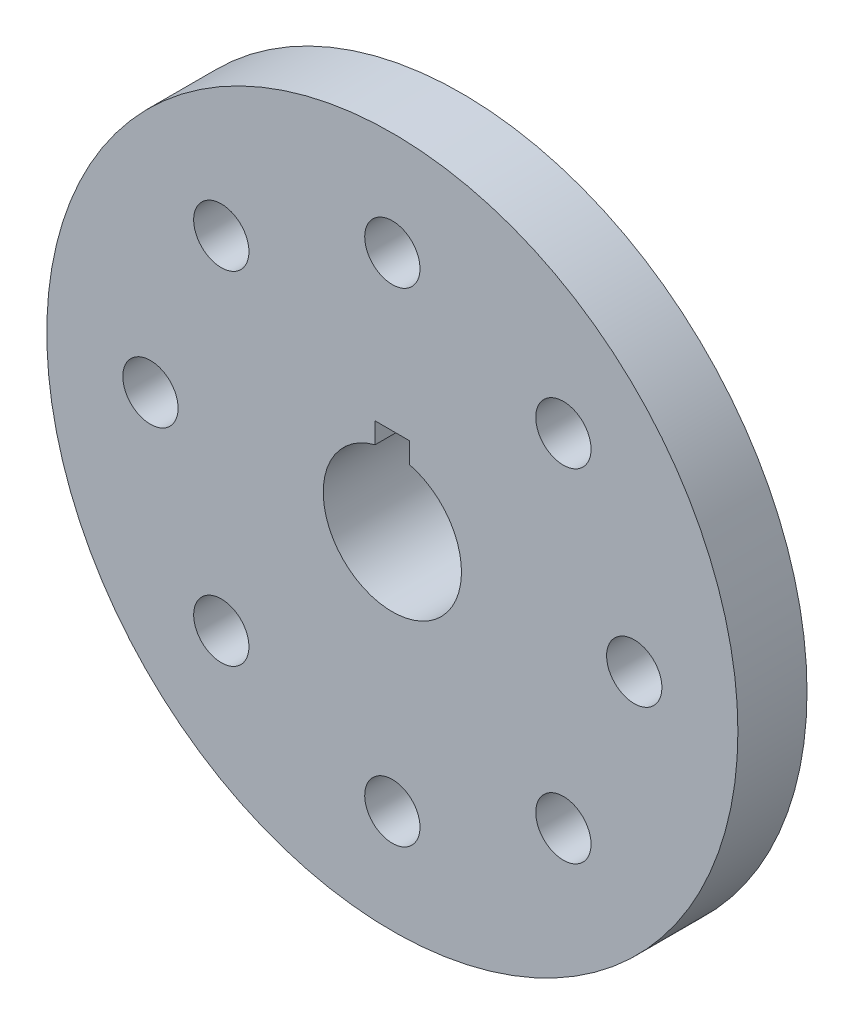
ISO-10303-21;
HEADER;
FILE_DESCRIPTION(('STEP AP214'),'2;1');
FILE_NAME('part.step','',(''),(''),'','','');
FILE_SCHEMA(('AUTOMOTIVE_DESIGN { 1 0 10303 214 1 1 1 1 }'));
ENDSEC;
DATA;
#1=APPLICATION_CONTEXT('core data for automotive mechanical design processes');
#2=APPLICATION_PROTOCOL_DEFINITION('international standard','automotive_design',2000,#1);
#3=PRODUCT_CONTEXT('',#1,'mechanical');
#4=PRODUCT('Part','Part','',(#3));
#5=PRODUCT_RELATED_PRODUCT_CATEGORY('part','',(#4));
#6=PRODUCT_DEFINITION_FORMATION('','',#4);
#7=PRODUCT_DEFINITION_CONTEXT('part definition',#1,'design');
#8=PRODUCT_DEFINITION('design','',#6,#7);
#9=PRODUCT_DEFINITION_SHAPE('','',#8);
#10=(LENGTH_UNIT() NAMED_UNIT(*) SI_UNIT(.MILLI.,.METRE.));
#11=(NAMED_UNIT(*) PLANE_ANGLE_UNIT() SI_UNIT($,.RADIAN.));
#12=(NAMED_UNIT(*) SI_UNIT($,.STERADIAN.) SOLID_ANGLE_UNIT());
#13=UNCERTAINTY_MEASURE_WITH_UNIT(LENGTH_MEASURE(1.E-05),#10,'distance_accuracy_value','');
#14=(GEOMETRIC_REPRESENTATION_CONTEXT(3) GLOBAL_UNCERTAINTY_ASSIGNED_CONTEXT((#13)) GLOBAL_UNIT_ASSIGNED_CONTEXT((#10,
#11,#12)) REPRESENTATION_CONTEXT('',''));
#15=CARTESIAN_POINT('',(0.,0.,0.));
#16=DIRECTION('',(0.,0.,1.));
#17=DIRECTION('',(1.,0.,0.));
#18=AXIS2_PLACEMENT_3D('',#15,#16,#17);
#19=CARTESIAN_POINT('',(0.,0.,-100.));
#20=DIRECTION('',(0.,0.,1.));
#21=DIRECTION('',(-1.,0.,0.));
#22=AXIS2_PLACEMENT_3D('',#19,#20,#21);
#23=PLANE('',#22);
#24=CARTESIAN_POINT('',(0.,0.,-100.));
#25=DIRECTION('',(0.,0.,1.));
#26=DIRECTION('',(1.,0.,0.));
#27=AXIS2_PLACEMENT_3D('',#24,#25,#26);
#28=CIRCLE('',#27,10.);
#29=CARTESIAN_POINT('',(-2.5,9.68245836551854,-100.));
#30=VERTEX_POINT('',#29);
#31=CARTESIAN_POINT('',(2.5,9.68245836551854,-100.));
#32=VERTEX_POINT('',#31);
#33=EDGE_CURVE('E68',#30,#32,#28,.T.);
#34=ORIENTED_EDGE('',*,*,#33,.T.);
#35=DIRECTION('',(0.,1.,0.));
#36=VECTOR('',#35,1.);
#37=CARTESIAN_POINT('',(2.5,9.68245836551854,-100.));
#38=LINE('',#37,#36);
#39=CARTESIAN_POINT('',(2.5,12.6824583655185,-100.));
#40=VERTEX_POINT('',#39);
#41=EDGE_CURVE('E76',#32,#40,#38,.T.);
#42=ORIENTED_EDGE('',*,*,#41,.T.);
#43=DIRECTION('',(-1.,0.,0.));
#44=VECTOR('',#43,1.);
#45=CARTESIAN_POINT('',(2.5,12.6824583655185,-100.));
#46=LINE('',#45,#44);
#47=CARTESIAN_POINT('',(-2.5,12.6824583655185,-100.));
#48=VERTEX_POINT('',#47);
#49=EDGE_CURVE('E81',#40,#48,#46,.T.);
#50=ORIENTED_EDGE('',*,*,#49,.T.);
#51=DIRECTION('',(0.,-1.,0.));
#52=VECTOR('',#51,1.);
#53=CARTESIAN_POINT('',(-2.5,9.68245836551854,-100.));
#54=LINE('',#53,#52);
#55=EDGE_CURVE('E86',#48,#30,#54,.T.);
#56=ORIENTED_EDGE('',*,*,#55,.T.);
#57=EDGE_LOOP('',(#34,#42,#50,#56));
#58=FACE_BOUND('',#57,.T.);
#59=CARTESIAN_POINT('',(0.,0.,-100.));
#60=DIRECTION('',(0.,0.,1.));
#61=DIRECTION('',(1.,0.,0.));
#62=AXIS2_PLACEMENT_3D('',#59,#60,#61);
#63=CIRCLE('',#62,20.);
#64=CARTESIAN_POINT('',(20.,0.,-100.));
#65=VERTEX_POINT('',#64);
#66=EDGE_CURVE('E11',#65,#65,#63,.T.);
#67=ORIENTED_EDGE('',*,*,#66,.F.);
#68=EDGE_LOOP('',(#67));
#69=FACE_BOUND('',#68,.T.);
#70=ADVANCED_FACE('F28',(#58,#69),#23,.F.);
#71=CARTESIAN_POINT('',(0.,0.,-100.));
#72=DIRECTION('',(0.,0.,-1.));
#73=DIRECTION('',(1.,0.,0.));
#74=AXIS2_PLACEMENT_3D('',#71,#72,#73);
#75=CYLINDRICAL_SURFACE('',#74,20.);
#76=ORIENTED_EDGE('',*,*,#66,.T.);
#77=EDGE_LOOP('',(#76));
#78=FACE_BOUND('',#77,.T.);
#79=CARTESIAN_POINT('',(0.,0.,-85.));
#80=DIRECTION('',(0.,0.,1.));
#81=DIRECTION('',(1.,0.,0.));
#82=AXIS2_PLACEMENT_3D('',#79,#80,#81);
#83=CIRCLE('',#82,20.);
#84=CARTESIAN_POINT('',(20.,0.,-85.));
#85=VERTEX_POINT('',#84);
#86=EDGE_CURVE('E35',#85,#85,#83,.T.);
#87=ORIENTED_EDGE('',*,*,#86,.F.);
#88=EDGE_LOOP('',(#87));
#89=FACE_BOUND('',#88,.T.);
#90=ADVANCED_FACE('F106',(#78,#89),#75,.T.);
#91=CARTESIAN_POINT('',(0.,20.,-85.));
#92=DIRECTION('',(0.,0.,1.));
#93=DIRECTION('',(-1.,0.,0.));
#94=AXIS2_PLACEMENT_3D('',#91,#92,#93);
#95=PLANE('',#94);
#96=CARTESIAN_POINT('',(35.,4.92661467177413E-13,-85.));
#97=DIRECTION('',(0.,0.,1.));
#98=DIRECTION('',(0.707106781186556,-0.707106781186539,0.));
#99=AXIS2_PLACEMENT_3D('',#96,#97,#98);
#100=CIRCLE('',#99,4.);
#101=CARTESIAN_POINT('',(37.8284271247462,-2.82842712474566,-85.));
#102=VERTEX_POINT('',#101);
#103=EDGE_CURVE('E181',#102,#102,#100,.T.);
#104=ORIENTED_EDGE('',*,*,#103,.T.);
#105=EDGE_LOOP('',(#104));
#106=FACE_BOUND('',#105,.T.);
#107=CARTESIAN_POINT('',(24.7487373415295,-24.7487373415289,-85.));
#108=DIRECTION('',(0.,0.,1.));
#109=DIRECTION('',(0.,-1.,0.));
#110=AXIS2_PLACEMENT_3D('',#107,#108,#109);
#111=CIRCLE('',#110,4.);
#112=CARTESIAN_POINT('',(24.7487373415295,-28.7487373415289,-85.));
#113=VERTEX_POINT('',#112);
#114=EDGE_CURVE('E189',#113,#113,#111,.T.);
#115=ORIENTED_EDGE('',*,*,#114,.T.);
#116=EDGE_LOOP('',(#115));
#117=FACE_BOUND('',#116,.T.);
#118=CARTESIAN_POINT('',(3.71230823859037E-13,-35.,-85.));
#119=DIRECTION('',(0.,0.,1.));
#120=DIRECTION('',(-0.707106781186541,-0.707106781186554,0.));
#121=AXIS2_PLACEMENT_3D('',#118,#119,#120);
#122=CIRCLE('',#121,4.);
#123=CARTESIAN_POINT('',(-2.82842712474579,-37.8284271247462,-85.));
#124=VERTEX_POINT('',#123);
#125=EDGE_CURVE('E195',#124,#124,#122,.T.);
#126=ORIENTED_EDGE('',*,*,#125,.T.);
#127=EDGE_LOOP('',(#126));
#128=FACE_BOUND('',#127,.T.);
#129=CARTESIAN_POINT('',(-24.7487373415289,-24.7487373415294,-85.));
#130=DIRECTION('',(0.,0.,1.));
#131=DIRECTION('',(-1.,0.,0.));
#132=AXIS2_PLACEMENT_3D('',#129,#130,#131);
#133=CIRCLE('',#132,4.);
#134=CARTESIAN_POINT('',(-28.7487373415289,-24.7487373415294,-85.));
#135=VERTEX_POINT('',#134);
#136=EDGE_CURVE('E201',#135,#135,#133,.T.);
#137=ORIENTED_EDGE('',*,*,#136,.T.);
#138=EDGE_LOOP('',(#137));
#139=FACE_BOUND('',#138,.T.);
#140=CARTESIAN_POINT('',(-35.,-2.4980018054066E-13,-85.));
#141=DIRECTION('',(0.,0.,1.));
#142=DIRECTION('',(-0.707106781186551,0.707106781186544,0.));
#143=AXIS2_PLACEMENT_3D('',#140,#141,#142);
#144=CIRCLE('',#143,4.);
#145=CARTESIAN_POINT('',(-37.8284271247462,2.82842712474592,-85.));
#146=VERTEX_POINT('',#145);
#147=EDGE_CURVE('E207',#146,#146,#144,.T.);
#148=ORIENTED_EDGE('',*,*,#147,.T.);
#149=EDGE_LOOP('',(#148));
#150=FACE_BOUND('',#149,.T.);
#151=CARTESIAN_POINT('',(-24.7487373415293,24.748737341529,-85.));
#152=DIRECTION('',(0.,0.,1.));
#153=DIRECTION('',(0.,1.,0.));
#154=AXIS2_PLACEMENT_3D('',#151,#152,#153);
#155=CIRCLE('',#154,4.);
#156=CARTESIAN_POINT('',(-24.7487373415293,28.748737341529,-85.));
#157=VERTEX_POINT('',#156);
#158=EDGE_CURVE('E213',#157,#157,#155,.T.);
#159=ORIENTED_EDGE('',*,*,#158,.T.);
#160=EDGE_LOOP('',(#159));
#161=FACE_BOUND('',#160,.T.);
#162=CARTESIAN_POINT('',(-1.28369537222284E-13,35.,-85.));
#163=DIRECTION('',(0.,0.,1.));
#164=DIRECTION('',(0.707106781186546,0.707106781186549,0.));
#165=AXIS2_PLACEMENT_3D('',#162,#163,#164);
#166=CIRCLE('',#165,4.);
#167=CARTESIAN_POINT('',(2.82842712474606,37.8284271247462,-85.));
#168=VERTEX_POINT('',#167);
#169=EDGE_CURVE('E219',#168,#168,#166,.T.);
#170=ORIENTED_EDGE('',*,*,#169,.T.);
#171=EDGE_LOOP('',(#170));
#172=FACE_BOUND('',#171,.T.);
#173=CARTESIAN_POINT('',(24.7487373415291,24.7487373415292,-85.));
#174=DIRECTION('',(0.,0.,1.));
#175=DIRECTION('',(1.,0.,0.));
#176=AXIS2_PLACEMENT_3D('',#173,#174,#175);
#177=CIRCLE('',#176,4.);
#178=CARTESIAN_POINT('',(28.7487373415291,24.7487373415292,-85.));
#179=VERTEX_POINT('',#178);
#180=EDGE_CURVE('E92',#179,#179,#177,.T.);
#181=ORIENTED_EDGE('',*,*,#180,.T.);
#182=EDGE_LOOP('',(#181));
#183=FACE_BOUND('',#182,.T.);
#184=ORIENTED_EDGE('',*,*,#86,.T.);
#185=EDGE_LOOP('',(#184));
#186=FACE_BOUND('',#185,.T.);
#187=CARTESIAN_POINT('',(0.,0.,-85.));
#188=DIRECTION('',(0.,0.,1.));
#189=DIRECTION('',(1.,0.,0.));
#190=AXIS2_PLACEMENT_3D('',#187,#188,#189);
#191=CIRCLE('',#190,50.);
#192=CARTESIAN_POINT('',(50.,0.,-85.));
#193=VERTEX_POINT('',#192);
#194=EDGE_CURVE('E98',#193,#193,#191,.T.);
#195=ORIENTED_EDGE('',*,*,#194,.F.);
#196=EDGE_LOOP('',(#195));
#197=FACE_BOUND('',#196,.T.);
#198=ADVANCED_FACE('F103',(#106,#117,#128,#139,#150,#161,#172,#183,#186,#197),#95,.F.);
#199=CARTESIAN_POINT('',(0.,0.,-100.));
#200=DIRECTION('',(0.,0.,-1.));
#201=DIRECTION('',(1.,0.,0.));
#202=AXIS2_PLACEMENT_3D('',#199,#200,#201);
#203=CYLINDRICAL_SURFACE('',#202,50.);
#204=ORIENTED_EDGE('',*,*,#194,.T.);
#205=EDGE_LOOP('',(#204));
#206=FACE_BOUND('',#205,.T.);
#207=CARTESIAN_POINT('',(0.,0.,-75.));
#208=DIRECTION('',(0.,0.,1.));
#209=DIRECTION('',(1.,0.,0.));
#210=AXIS2_PLACEMENT_3D('',#207,#208,#209);
#211=CIRCLE('',#210,50.);
#212=CARTESIAN_POINT('',(50.,0.,-75.));
#213=VERTEX_POINT('',#212);
#214=EDGE_CURVE('E89',#213,#213,#211,.T.);
#215=ORIENTED_EDGE('',*,*,#214,.F.);
#216=EDGE_LOOP('',(#215));
#217=FACE_BOUND('',#216,.T.);
#218=ADVANCED_FACE('F113',(#206,#217),#203,.T.);
#219=CARTESIAN_POINT('',(0.,50.,-75.));
#220=DIRECTION('',(0.,0.,-1.));
#221=DIRECTION('',(1.,0.,0.));
#222=AXIS2_PLACEMENT_3D('',#219,#220,#221);
#223=PLANE('',#222);
#224=CARTESIAN_POINT('',(35.,4.92661467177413E-13,-75.));
#225=DIRECTION('',(0.,0.,1.));
#226=DIRECTION('',(0.707106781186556,-0.707106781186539,0.));
#227=AXIS2_PLACEMENT_3D('',#224,#225,#226);
#228=CIRCLE('',#227,4.);
#229=CARTESIAN_POINT('',(37.8284271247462,-2.82842712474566,-75.));
#230=VERTEX_POINT('',#229);
#231=EDGE_CURVE('E186',#230,#230,#228,.T.);
#232=ORIENTED_EDGE('',*,*,#231,.F.);
#233=EDGE_LOOP('',(#232));
#234=FACE_BOUND('',#233,.T.);
#235=CARTESIAN_POINT('',(24.7487373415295,-24.7487373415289,-75.));
#236=DIRECTION('',(0.,0.,1.));
#237=DIRECTION('',(0.,-1.,0.));
#238=AXIS2_PLACEMENT_3D('',#235,#236,#237);
#239=CIRCLE('',#238,4.);
#240=CARTESIAN_POINT('',(24.7487373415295,-28.7487373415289,-75.));
#241=VERTEX_POINT('',#240);
#242=EDGE_CURVE('E192',#241,#241,#239,.T.);
#243=ORIENTED_EDGE('',*,*,#242,.F.);
#244=EDGE_LOOP('',(#243));
#245=FACE_BOUND('',#244,.T.);
#246=CARTESIAN_POINT('',(3.71230823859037E-13,-35.,-75.));
#247=DIRECTION('',(0.,0.,1.));
#248=DIRECTION('',(-0.707106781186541,-0.707106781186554,0.));
#249=AXIS2_PLACEMENT_3D('',#246,#247,#248);
#250=CIRCLE('',#249,4.);
#251=CARTESIAN_POINT('',(-2.82842712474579,-37.8284271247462,-75.));
#252=VERTEX_POINT('',#251);
#253=EDGE_CURVE('E198',#252,#252,#250,.T.);
#254=ORIENTED_EDGE('',*,*,#253,.F.);
#255=EDGE_LOOP('',(#254));
#256=FACE_BOUND('',#255,.T.);
#257=CARTESIAN_POINT('',(-24.7487373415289,-24.7487373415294,-75.));
#258=DIRECTION('',(0.,0.,1.));
#259=DIRECTION('',(-1.,0.,0.));
#260=AXIS2_PLACEMENT_3D('',#257,#258,#259);
#261=CIRCLE('',#260,4.);
#262=CARTESIAN_POINT('',(-28.7487373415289,-24.7487373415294,-75.));
#263=VERTEX_POINT('',#262);
#264=EDGE_CURVE('E204',#263,#263,#261,.T.);
#265=ORIENTED_EDGE('',*,*,#264,.F.);
#266=EDGE_LOOP('',(#265));
#267=FACE_BOUND('',#266,.T.);
#268=CARTESIAN_POINT('',(-35.,-2.4980018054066E-13,-75.));
#269=DIRECTION('',(0.,0.,1.));
#270=DIRECTION('',(-0.707106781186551,0.707106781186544,0.));
#271=AXIS2_PLACEMENT_3D('',#268,#269,#270);
#272=CIRCLE('',#271,4.);
#273=CARTESIAN_POINT('',(-37.8284271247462,2.82842712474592,-75.));
#274=VERTEX_POINT('',#273);
#275=EDGE_CURVE('E210',#274,#274,#272,.T.);
#276=ORIENTED_EDGE('',*,*,#275,.F.);
#277=EDGE_LOOP('',(#276));
#278=FACE_BOUND('',#277,.T.);
#279=CARTESIAN_POINT('',(-24.7487373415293,24.748737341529,-75.));
#280=DIRECTION('',(0.,0.,1.));
#281=DIRECTION('',(0.,1.,0.));
#282=AXIS2_PLACEMENT_3D('',#279,#280,#281);
#283=CIRCLE('',#282,4.);
#284=CARTESIAN_POINT('',(-24.7487373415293,28.748737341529,-75.));
#285=VERTEX_POINT('',#284);
#286=EDGE_CURVE('E216',#285,#285,#283,.T.);
#287=ORIENTED_EDGE('',*,*,#286,.F.);
#288=EDGE_LOOP('',(#287));
#289=FACE_BOUND('',#288,.T.);
#290=CARTESIAN_POINT('',(-1.28369537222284E-13,35.,-75.));
#291=DIRECTION('',(0.,0.,1.));
#292=DIRECTION('',(0.707106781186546,0.707106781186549,0.));
#293=AXIS2_PLACEMENT_3D('',#290,#291,#292);
#294=CIRCLE('',#293,4.);
#295=CARTESIAN_POINT('',(2.82842712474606,37.8284271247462,-75.));
#296=VERTEX_POINT('',#295);
#297=EDGE_CURVE('E222',#296,#296,#294,.T.);
#298=ORIENTED_EDGE('',*,*,#297,.F.);
#299=EDGE_LOOP('',(#298));
#300=FACE_BOUND('',#299,.T.);
#301=CARTESIAN_POINT('',(24.7487373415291,24.7487373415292,-75.));
#302=DIRECTION('',(0.,0.,1.));
#303=DIRECTION('',(1.,0.,0.));
#304=AXIS2_PLACEMENT_3D('',#301,#302,#303);
#305=CIRCLE('',#304,4.);
#306=CARTESIAN_POINT('',(28.7487373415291,24.7487373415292,-75.));
#307=VERTEX_POINT('',#306);
#308=EDGE_CURVE('E87',#307,#307,#305,.T.);
#309=ORIENTED_EDGE('',*,*,#308,.F.);
#310=EDGE_LOOP('',(#309));
#311=FACE_BOUND('',#310,.T.);
#312=DIRECTION('',(-1.,0.,0.));
#313=VECTOR('',#312,1.);
#314=CARTESIAN_POINT('',(2.5,12.6824583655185,-75.));
#315=LINE('',#314,#313);
#316=CARTESIAN_POINT('',(2.5,12.6824583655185,-75.));
#317=VERTEX_POINT('',#316);
#318=CARTESIAN_POINT('',(-2.5,12.6824583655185,-75.));
#319=VERTEX_POINT('',#318);
#320=EDGE_CURVE('E176',#317,#319,#315,.T.);
#321=ORIENTED_EDGE('',*,*,#320,.F.);
#322=DIRECTION('',(0.,1.,0.));
#323=VECTOR('',#322,1.);
#324=CARTESIAN_POINT('',(2.5,9.68245836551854,-75.));
#325=LINE('',#324,#323);
#326=CARTESIAN_POINT('',(2.5,9.68245836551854,-75.));
#327=VERTEX_POINT('',#326);
#328=EDGE_CURVE('E171',#327,#317,#325,.T.);
#329=ORIENTED_EDGE('',*,*,#328,.F.);
#330=CARTESIAN_POINT('',(0.,0.,-75.));
#331=DIRECTION('',(0.,0.,1.));
#332=DIRECTION('',(1.,0.,0.));
#333=AXIS2_PLACEMENT_3D('',#330,#331,#332);
#334=CIRCLE('',#333,10.);
#335=CARTESIAN_POINT('',(-2.5,9.68245836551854,-75.));
#336=VERTEX_POINT('',#335);
#337=EDGE_CURVE('E70',#336,#327,#334,.T.);
#338=ORIENTED_EDGE('',*,*,#337,.F.);
#339=DIRECTION('',(0.,-1.,0.));
#340=VECTOR('',#339,1.);
#341=CARTESIAN_POINT('',(-2.5,9.68245836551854,-75.));
#342=LINE('',#341,#340);
#343=EDGE_CURVE('E73',#319,#336,#342,.T.);
#344=ORIENTED_EDGE('',*,*,#343,.F.);
#345=EDGE_LOOP('',(#321,#329,#338,#344));
#346=FACE_BOUND('',#345,.T.);
#347=ORIENTED_EDGE('',*,*,#214,.T.);
#348=EDGE_LOOP('',(#347));
#349=FACE_BOUND('',#348,.T.);
#350=ADVANCED_FACE('F119',(#234,#245,#256,#267,#278,#289,#300,#311,#346,#349),#223,.F.);
#351=CARTESIAN_POINT('',(0.,0.,-75.));
#352=DIRECTION('',(0.,0.,-1.));
#353=DIRECTION('',(1.,0.,0.));
#354=AXIS2_PLACEMENT_3D('',#351,#352,#353);
#355=CYLINDRICAL_SURFACE('',#354,10.);
#356=ORIENTED_EDGE('',*,*,#337,.T.);
#357=DIRECTION('',(0.,0.,-1.));
#358=VECTOR('',#357,1.);
#359=CARTESIAN_POINT('',(2.5,9.68245836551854,-75.));
#360=LINE('',#359,#358);
#361=EDGE_CURVE('E42',#327,#32,#360,.T.);
#362=ORIENTED_EDGE('',*,*,#361,.T.);
#363=ORIENTED_EDGE('',*,*,#33,.F.);
#364=DIRECTION('',(0.,0.,-1.));
#365=VECTOR('',#364,1.);
#366=CARTESIAN_POINT('',(-2.5,9.68245836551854,-75.));
#367=LINE('',#366,#365);
#368=EDGE_CURVE('E49',#336,#30,#367,.T.);
#369=ORIENTED_EDGE('',*,*,#368,.F.);
#370=EDGE_LOOP('',(#356,#362,#363,#369));
#371=FACE_BOUND('',#370,.T.);
#372=ADVANCED_FACE('F66',(#371),#355,.F.);
#373=CARTESIAN_POINT('',(24.7487373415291,24.7487373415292,-75.));
#374=DIRECTION('',(0.,0.,-1.));
#375=DIRECTION('',(1.,0.,0.));
#376=AXIS2_PLACEMENT_3D('',#373,#374,#375);
#377=CYLINDRICAL_SURFACE('',#376,4.);
#378=ORIENTED_EDGE('',*,*,#308,.T.);
#379=EDGE_LOOP('',(#378));
#380=FACE_BOUND('',#379,.T.);
#381=ORIENTED_EDGE('',*,*,#180,.F.);
#382=EDGE_LOOP('',(#381));
#383=FACE_BOUND('',#382,.T.);
#384=ADVANCED_FACE('F126',(#380,#383),#377,.F.);
#385=CARTESIAN_POINT('',(-1.28369537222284E-13,35.,-75.));
#386=DIRECTION('',(0.,0.,-1.));
#387=DIRECTION('',(1.,0.,0.));
#388=AXIS2_PLACEMENT_3D('',#385,#386,#387);
#389=CYLINDRICAL_SURFACE('',#388,4.);
#390=ORIENTED_EDGE('',*,*,#297,.T.);
#391=EDGE_LOOP('',(#390));
#392=FACE_BOUND('',#391,.T.);
#393=ORIENTED_EDGE('',*,*,#169,.F.);
#394=EDGE_LOOP('',(#393));
#395=FACE_BOUND('',#394,.T.);
#396=ADVANCED_FACE('F129',(#392,#395),#389,.F.);
#397=CARTESIAN_POINT('',(-24.7487373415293,24.748737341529,-75.));
#398=DIRECTION('',(0.,0.,-1.));
#399=DIRECTION('',(1.,0.,0.));
#400=AXIS2_PLACEMENT_3D('',#397,#398,#399);
#401=CYLINDRICAL_SURFACE('',#400,4.);
#402=ORIENTED_EDGE('',*,*,#286,.T.);
#403=EDGE_LOOP('',(#402));
#404=FACE_BOUND('',#403,.T.);
#405=ORIENTED_EDGE('',*,*,#158,.F.);
#406=EDGE_LOOP('',(#405));
#407=FACE_BOUND('',#406,.T.);
#408=ADVANCED_FACE('F133',(#404,#407),#401,.F.);
#409=CARTESIAN_POINT('',(-35.,-2.4980018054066E-13,-75.));
#410=DIRECTION('',(0.,0.,-1.));
#411=DIRECTION('',(1.,0.,0.));
#412=AXIS2_PLACEMENT_3D('',#409,#410,#411);
#413=CYLINDRICAL_SURFACE('',#412,4.);
#414=ORIENTED_EDGE('',*,*,#275,.T.);
#415=EDGE_LOOP('',(#414));
#416=FACE_BOUND('',#415,.T.);
#417=ORIENTED_EDGE('',*,*,#147,.F.);
#418=EDGE_LOOP('',(#417));
#419=FACE_BOUND('',#418,.T.);
#420=ADVANCED_FACE('F137',(#416,#419),#413,.F.);
#421=CARTESIAN_POINT('',(-24.7487373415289,-24.7487373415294,-75.));
#422=DIRECTION('',(0.,0.,-1.));
#423=DIRECTION('',(1.,0.,0.));
#424=AXIS2_PLACEMENT_3D('',#421,#422,#423);
#425=CYLINDRICAL_SURFACE('',#424,4.);
#426=ORIENTED_EDGE('',*,*,#264,.T.);
#427=EDGE_LOOP('',(#426));
#428=FACE_BOUND('',#427,.T.);
#429=ORIENTED_EDGE('',*,*,#136,.F.);
#430=EDGE_LOOP('',(#429));
#431=FACE_BOUND('',#430,.T.);
#432=ADVANCED_FACE('F141',(#428,#431),#425,.F.);
#433=CARTESIAN_POINT('',(3.71230823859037E-13,-35.,-75.));
#434=DIRECTION('',(0.,0.,-1.));
#435=DIRECTION('',(1.,0.,0.));
#436=AXIS2_PLACEMENT_3D('',#433,#434,#435);
#437=CYLINDRICAL_SURFACE('',#436,4.);
#438=ORIENTED_EDGE('',*,*,#253,.T.);
#439=EDGE_LOOP('',(#438));
#440=FACE_BOUND('',#439,.T.);
#441=ORIENTED_EDGE('',*,*,#125,.F.);
#442=EDGE_LOOP('',(#441));
#443=FACE_BOUND('',#442,.T.);
#444=ADVANCED_FACE('F145',(#440,#443),#437,.F.);
#445=CARTESIAN_POINT('',(24.7487373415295,-24.7487373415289,-75.));
#446=DIRECTION('',(0.,0.,-1.));
#447=DIRECTION('',(1.,0.,0.));
#448=AXIS2_PLACEMENT_3D('',#445,#446,#447);
#449=CYLINDRICAL_SURFACE('',#448,4.);
#450=ORIENTED_EDGE('',*,*,#242,.T.);
#451=EDGE_LOOP('',(#450));
#452=FACE_BOUND('',#451,.T.);
#453=ORIENTED_EDGE('',*,*,#114,.F.);
#454=EDGE_LOOP('',(#453));
#455=FACE_BOUND('',#454,.T.);
#456=ADVANCED_FACE('F149',(#452,#455),#449,.F.);
#457=CARTESIAN_POINT('',(35.,4.92661467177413E-13,-75.));
#458=DIRECTION('',(0.,0.,-1.));
#459=DIRECTION('',(1.,0.,0.));
#460=AXIS2_PLACEMENT_3D('',#457,#458,#459);
#461=CYLINDRICAL_SURFACE('',#460,4.);
#462=ORIENTED_EDGE('',*,*,#231,.T.);
#463=EDGE_LOOP('',(#462));
#464=FACE_BOUND('',#463,.T.);
#465=ORIENTED_EDGE('',*,*,#103,.F.);
#466=EDGE_LOOP('',(#465));
#467=FACE_BOUND('',#466,.T.);
#468=ADVANCED_FACE('F153',(#464,#467),#461,.F.);
#469=CARTESIAN_POINT('',(-2.5,9.68245836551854,-75.));
#470=DIRECTION('',(-1.,0.,0.));
#471=DIRECTION('',(0.,0.,-1.));
#472=AXIS2_PLACEMENT_3D('',#469,#470,#471);
#473=PLANE('',#472);
#474=ORIENTED_EDGE('',*,*,#55,.F.);
#475=DIRECTION('',(0.,0.,-1.));
#476=VECTOR('',#475,1.);
#477=CARTESIAN_POINT('',(-2.5,12.6824583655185,-75.));
#478=LINE('',#477,#476);
#479=EDGE_CURVE('E169',#319,#48,#478,.T.);
#480=ORIENTED_EDGE('',*,*,#479,.F.);
#481=ORIENTED_EDGE('',*,*,#343,.T.);
#482=ORIENTED_EDGE('',*,*,#368,.T.);
#483=EDGE_LOOP('',(#474,#480,#481,#482));
#484=FACE_BOUND('',#483,.T.);
#485=ADVANCED_FACE('F157',(#484),#473,.F.);
#486=CARTESIAN_POINT('',(2.5,12.6824583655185,-75.));
#487=DIRECTION('',(0.,1.,0.));
#488=DIRECTION('',(0.,0.,-1.));
#489=AXIS2_PLACEMENT_3D('',#486,#487,#488);
#490=PLANE('',#489);
#491=ORIENTED_EDGE('',*,*,#49,.F.);
#492=DIRECTION('',(0.,0.,-1.));
#493=VECTOR('',#492,1.);
#494=CARTESIAN_POINT('',(2.5,12.6824583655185,-75.));
#495=LINE('',#494,#493);
#496=EDGE_CURVE('E72',#317,#40,#495,.T.);
#497=ORIENTED_EDGE('',*,*,#496,.F.);
#498=ORIENTED_EDGE('',*,*,#320,.T.);
#499=ORIENTED_EDGE('',*,*,#479,.T.);
#500=EDGE_LOOP('',(#491,#497,#498,#499));
#501=FACE_BOUND('',#500,.T.);
#502=ADVANCED_FACE('F161',(#501),#490,.F.);
#503=CARTESIAN_POINT('',(2.5,9.68245836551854,-75.));
#504=DIRECTION('',(1.,0.,0.));
#505=DIRECTION('',(0.,0.,1.));
#506=AXIS2_PLACEMENT_3D('',#503,#504,#505);
#507=PLANE('',#506);
#508=ORIENTED_EDGE('',*,*,#41,.F.);
#509=ORIENTED_EDGE('',*,*,#361,.F.);
#510=ORIENTED_EDGE('',*,*,#328,.T.);
#511=ORIENTED_EDGE('',*,*,#496,.T.);
#512=EDGE_LOOP('',(#508,#509,#510,#511));
#513=FACE_BOUND('',#512,.T.);
#514=ADVANCED_FACE('F77',(#513),#507,.F.);
#515=CLOSED_SHELL('',(#70,#90,#198,#218,#350,#372,#384,#396,#408,#420,#432,#444,#456,#468,#485,
#502,#514));
#516=MANIFOLD_SOLID_BREP('B2',#515);
#517=ADVANCED_BREP_SHAPE_REPRESENTATION('',(#18,#516),#14);
#518=SHAPE_DEFINITION_REPRESENTATION(#9,#517);
ENDSEC;
END-ISO-10303-21;
